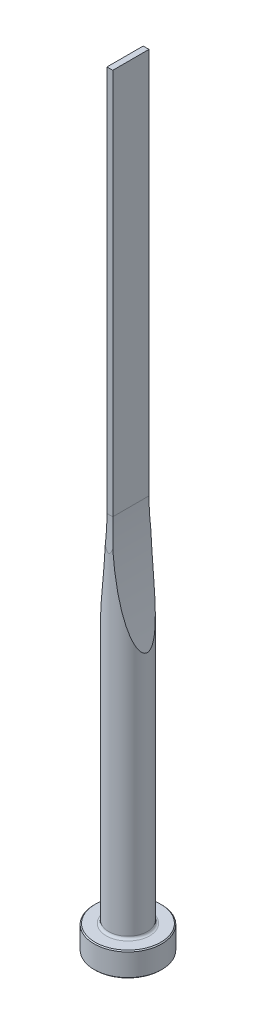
from build123d import *

# Parameters (mm, degrees)
CUT_EXTRUDE1_DEPTH = 5
CUT_EXTRUDE2_DEPTH = 5


with BuildPart() as part:
    # Sketch1 → Revolve1 (revolve)
    with BuildSketch(Plane.XY, mode=Mode.PRIVATE) as revolve1_sk:
        with BuildLine():
            Line((0, 0), (6.8, 0))
            Line((6.8, 0), (7, 0.2))
            Line((7, 0.2), (7, 4.8))
            Line((7, 4.8), (6.8, 5))
            Line((6.8, 5), (4.5, 5))
            ThreePointArc((4.5, 5), (4.146446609, 5.146446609), (4, 5.5))
            Line((4, 5.5), (4, 160))
            Line((4, 160), (0, 160))
            Line((0, 160), (0, 0))
        make_face()
    revolve(revolve1_sk.sketch.rotate(Axis((0, 160, 0), (0, -1, 0)), 180), axis=Axis((0, 160, 0), (0, -1, 0)))

    # Sketch2 → Cut-Extrude1 (cut, symmetric)
    with BuildSketch(Plane.XY):
        with BuildLine():
            Line((0.6, 160), (0.6, 80))
            ThreePointArc((0.6, 80), (1.454052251, 67.630683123), (4, 55.496122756))
            Line((4, 55.496122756), (4, 160))
            Line((4, 160), (0.6, 160))
        make_face()
        with BuildLine():
            Line((-0.6, 160), (-0.6, 80))
            ThreePointArc((-0.6, 80), (-1.454052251, 67.630683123), (-4, 55.496122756))
            Line((-4, 55.496122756), (-4, 160))
            Line((-4, 160), (-0.6, 160))
        make_face()
    extrude(amount=CUT_EXTRUDE1_DEPTH, both=True, mode=Mode.SUBTRACT)

    # Sketch3 → Cut-Extrude2 (cut, symmetric)
    with BuildSketch(Plane(origin=(0, 0, 0), x_dir=(0, 0, -1), z_dir=(1, 0, 0))):
        with BuildLine():
            Line((3.75, 160), (3.75, 80))
            ThreePointArc((3.75, 80), (3.812521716, 76.645898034), (4, 73.296456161))
            Line((4, 73.296456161), (4, 160))
            Line((4, 160), (3.75, 160))
        make_face()
        with BuildLine():
            Line((-3.75, 160), (-3.75, 80))
            ThreePointArc((-3.75, 80), (-3.812521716, 76.645898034), (-4, 73.296456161))
            Line((-4, 73.296456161), (-4, 160))
            Line((-4, 160), (-3.75, 160))
        make_face()
    extrude(amount=CUT_EXTRUDE2_DEPTH, both=True, mode=Mode.SUBTRACT)


solid = part.part
